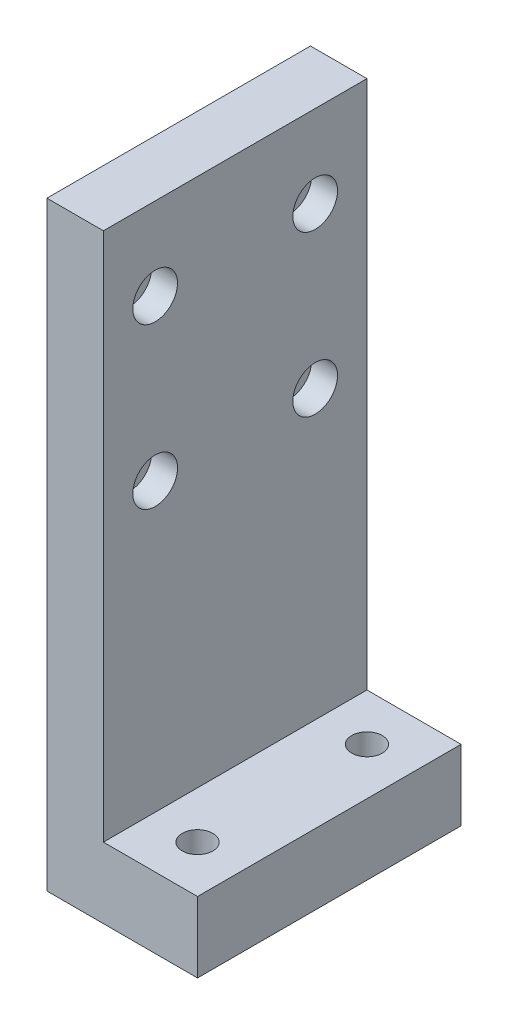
ISO-10303-21;
HEADER;
FILE_DESCRIPTION(('STEP AP214'),'2;1');
FILE_NAME('part.step','',(''),(''),'','','');
FILE_SCHEMA(('AUTOMOTIVE_DESIGN { 1 0 10303 214 1 1 1 1 }'));
ENDSEC;
DATA;
#1=APPLICATION_CONTEXT('core data for automotive mechanical design processes');
#2=APPLICATION_PROTOCOL_DEFINITION('international standard','automotive_design',2000,#1);
#3=PRODUCT_CONTEXT('',#1,'mechanical');
#4=PRODUCT('Part','Part','',(#3));
#5=PRODUCT_RELATED_PRODUCT_CATEGORY('part','',(#4));
#6=PRODUCT_DEFINITION_FORMATION('','',#4);
#7=PRODUCT_DEFINITION_CONTEXT('part definition',#1,'design');
#8=PRODUCT_DEFINITION('design','',#6,#7);
#9=PRODUCT_DEFINITION_SHAPE('','',#8);
#10=(LENGTH_UNIT() NAMED_UNIT(*) SI_UNIT(.MILLI.,.METRE.));
#11=(NAMED_UNIT(*) PLANE_ANGLE_UNIT() SI_UNIT($,.RADIAN.));
#12=(NAMED_UNIT(*) SI_UNIT($,.STERADIAN.) SOLID_ANGLE_UNIT());
#13=UNCERTAINTY_MEASURE_WITH_UNIT(LENGTH_MEASURE(1.E-05),#10,'distance_accuracy_value','');
#14=(GEOMETRIC_REPRESENTATION_CONTEXT(3) GLOBAL_UNCERTAINTY_ASSIGNED_CONTEXT((#13)) GLOBAL_UNIT_ASSIGNED_CONTEXT((#10,
#11,#12)) REPRESENTATION_CONTEXT('',''));
#15=CARTESIAN_POINT('',(0.,0.,0.));
#16=DIRECTION('',(0.,0.,1.));
#17=DIRECTION('',(1.,0.,0.));
#18=AXIS2_PLACEMENT_3D('',#15,#16,#17);
#19=CARTESIAN_POINT('',(-44.,75.9999999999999,45.));
#20=DIRECTION('',(1.,0.,0.));
#21=DIRECTION('',(0.,0.,-1.));
#22=AXIS2_PLACEMENT_3D('',#19,#20,#21);
#23=CYLINDRICAL_SURFACE('',#22,2.75);
#24=CARTESIAN_POINT('',(0.,75.9999999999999,45.));
#25=DIRECTION('',(1.,0.,0.));
#26=DIRECTION('',(0.,0.,-1.));
#27=AXIS2_PLACEMENT_3D('',#24,#25,#26);
#28=CIRCLE('',#27,2.75);
#29=CARTESIAN_POINT('',(0.,75.9999999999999,42.25));
#30=VERTEX_POINT('',#29);
#31=EDGE_CURVE('E144',#30,#30,#28,.T.);
#32=ORIENTED_EDGE('',*,*,#31,.F.);
#33=EDGE_LOOP('',(#32));
#34=FACE_BOUND('',#33,.T.);
#35=CARTESIAN_POINT('',(6.5,75.9999999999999,45.));
#36=DIRECTION('',(1.,0.,0.));
#37=DIRECTION('',(0.,0.,-1.));
#38=AXIS2_PLACEMENT_3D('',#35,#36,#37);
#39=CIRCLE('',#38,2.75);
#40=CARTESIAN_POINT('',(6.5,75.9999999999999,42.25));
#41=VERTEX_POINT('',#40);
#42=EDGE_CURVE('E161',#41,#41,#39,.F.);
#43=ORIENTED_EDGE('',*,*,#42,.F.);
#44=EDGE_LOOP('',(#43));
#45=FACE_BOUND('',#44,.T.);
#46=ADVANCED_FACE('F32',(#34,#45),#23,.F.);
#47=CARTESIAN_POINT('',(-44.,76.,11.));
#48=DIRECTION('',(1.,0.,0.));
#49=DIRECTION('',(0.,0.,-1.));
#50=AXIS2_PLACEMENT_3D('',#47,#48,#49);
#51=CYLINDRICAL_SURFACE('',#50,2.75);
#52=CARTESIAN_POINT('',(0.,76.,11.));
#53=DIRECTION('',(1.,0.,0.));
#54=DIRECTION('',(0.,0.,-1.));
#55=AXIS2_PLACEMENT_3D('',#52,#53,#54);
#56=CIRCLE('',#55,2.75);
#57=CARTESIAN_POINT('',(0.,76.,8.25));
#58=VERTEX_POINT('',#57);
#59=EDGE_CURVE('E141',#58,#58,#56,.T.);
#60=ORIENTED_EDGE('',*,*,#59,.F.);
#61=EDGE_LOOP('',(#60));
#62=FACE_BOUND('',#61,.T.);
#63=CARTESIAN_POINT('',(6.5,76.,11.));
#64=DIRECTION('',(1.,0.,0.));
#65=DIRECTION('',(0.,0.,-1.));
#66=AXIS2_PLACEMENT_3D('',#63,#64,#65);
#67=CIRCLE('',#66,2.75);
#68=CARTESIAN_POINT('',(6.5,76.,8.25));
#69=VERTEX_POINT('',#68);
#70=EDGE_CURVE('E156',#69,#69,#67,.F.);
#71=ORIENTED_EDGE('',*,*,#70,.F.);
#72=EDGE_LOOP('',(#71));
#73=FACE_BOUND('',#72,.T.);
#74=ADVANCED_FACE('F219',(#62,#73),#51,.F.);
#75=CARTESIAN_POINT('',(-44.,110.,11.));
#76=DIRECTION('',(1.,0.,0.));
#77=DIRECTION('',(0.,0.,-1.));
#78=AXIS2_PLACEMENT_3D('',#75,#76,#77);
#79=CYLINDRICAL_SURFACE('',#78,2.75);
#80=CARTESIAN_POINT('',(0.,110.,11.));
#81=DIRECTION('',(1.,0.,0.));
#82=DIRECTION('',(0.,0.,-1.));
#83=AXIS2_PLACEMENT_3D('',#80,#81,#82);
#84=CIRCLE('',#83,2.75);
#85=CARTESIAN_POINT('',(0.,110.,8.25));
#86=VERTEX_POINT('',#85);
#87=EDGE_CURVE('E138',#86,#86,#84,.T.);
#88=ORIENTED_EDGE('',*,*,#87,.F.);
#89=EDGE_LOOP('',(#88));
#90=FACE_BOUND('',#89,.T.);
#91=CARTESIAN_POINT('',(6.5,110.,11.));
#92=DIRECTION('',(1.,0.,0.));
#93=DIRECTION('',(0.,0.,-1.));
#94=AXIS2_PLACEMENT_3D('',#91,#92,#93);
#95=CIRCLE('',#94,2.75);
#96=CARTESIAN_POINT('',(6.5,110.,8.25));
#97=VERTEX_POINT('',#96);
#98=EDGE_CURVE('E151',#97,#97,#95,.F.);
#99=ORIENTED_EDGE('',*,*,#98,.F.);
#100=EDGE_LOOP('',(#99));
#101=FACE_BOUND('',#100,.T.);
#102=ADVANCED_FACE('F225',(#90,#101),#79,.F.);
#103=CARTESIAN_POINT('',(-44.,110.,45.));
#104=DIRECTION('',(1.,0.,0.));
#105=DIRECTION('',(0.,0.,-1.));
#106=AXIS2_PLACEMENT_3D('',#103,#104,#105);
#107=CYLINDRICAL_SURFACE('',#106,2.75);
#108=CARTESIAN_POINT('',(0.,110.,45.));
#109=DIRECTION('',(1.,0.,0.));
#110=DIRECTION('',(0.,0.,-1.));
#111=AXIS2_PLACEMENT_3D('',#108,#109,#110);
#112=CIRCLE('',#111,2.75);
#113=CARTESIAN_POINT('',(0.,110.,42.25));
#114=VERTEX_POINT('',#113);
#115=EDGE_CURVE('E123',#114,#114,#112,.T.);
#116=ORIENTED_EDGE('',*,*,#115,.F.);
#117=EDGE_LOOP('',(#116));
#118=FACE_BOUND('',#117,.T.);
#119=CARTESIAN_POINT('',(6.5,110.,45.));
#120=DIRECTION('',(1.,0.,0.));
#121=DIRECTION('',(0.,0.,-1.));
#122=AXIS2_PLACEMENT_3D('',#119,#120,#121);
#123=CIRCLE('',#122,2.75);
#124=CARTESIAN_POINT('',(6.5,110.,42.25));
#125=VERTEX_POINT('',#124);
#126=EDGE_CURVE('E147',#125,#125,#123,.F.);
#127=ORIENTED_EDGE('',*,*,#126,.F.);
#128=EDGE_LOOP('',(#127));
#129=FACE_BOUND('',#128,.T.);
#130=ADVANCED_FACE('F236',(#118,#129),#107,.F.);
#131=CARTESIAN_POINT('',(0.,0.,56.));
#132=DIRECTION('',(0.,1.,0.));
#133=DIRECTION('',(0.,0.,1.));
#134=AXIS2_PLACEMENT_3D('',#131,#132,#133);
#135=PLANE('',#134);
#136=CARTESIAN_POINT('',(22.,0.,46.));
#137=DIRECTION('',(0.,1.,0.));
#138=DIRECTION('',(0.,0.,1.));
#139=AXIS2_PLACEMENT_3D('',#136,#137,#138);
#140=CIRCLE('',#139,3.25);
#141=CARTESIAN_POINT('',(22.,0.,49.25));
#142=VERTEX_POINT('',#141);
#143=EDGE_CURVE('E178',#142,#142,#140,.T.);
#144=ORIENTED_EDGE('',*,*,#143,.T.);
#145=EDGE_LOOP('',(#144));
#146=FACE_BOUND('',#145,.T.);
#147=CARTESIAN_POINT('',(22.,0.,10.));
#148=DIRECTION('',(0.,1.,0.));
#149=DIRECTION('',(0.,0.,1.));
#150=AXIS2_PLACEMENT_3D('',#147,#148,#149);
#151=CIRCLE('',#150,3.25);
#152=CARTESIAN_POINT('',(22.,0.,13.25));
#153=VERTEX_POINT('',#152);
#154=EDGE_CURVE('E168',#153,#153,#151,.T.);
#155=ORIENTED_EDGE('',*,*,#154,.T.);
#156=EDGE_LOOP('',(#155));
#157=FACE_BOUND('',#156,.T.);
#158=DIRECTION('',(1.,0.,0.));
#159=VECTOR('',#158,1.);
#160=CARTESIAN_POINT('',(0.,0.,0.));
#161=LINE('',#160,#159);
#162=CARTESIAN_POINT('',(0.,0.,0.));
#163=VERTEX_POINT('',#162);
#164=CARTESIAN_POINT('',(32.,0.,0.));
#165=VERTEX_POINT('',#164);
#166=EDGE_CURVE('E119',#163,#165,#161,.T.);
#167=ORIENTED_EDGE('',*,*,#166,.T.);
#168=DIRECTION('',(0.,0.,-1.));
#169=VECTOR('',#168,1.);
#170=CARTESIAN_POINT('',(32.,0.,56.));
#171=LINE('',#170,#169);
#172=CARTESIAN_POINT('',(32.,0.,56.));
#173=VERTEX_POINT('',#172);
#174=EDGE_CURVE('E11',#173,#165,#171,.T.);
#175=ORIENTED_EDGE('',*,*,#174,.F.);
#176=DIRECTION('',(1.,0.,0.));
#177=VECTOR('',#176,1.);
#178=CARTESIAN_POINT('',(0.,0.,56.));
#179=LINE('',#178,#177);
#180=CARTESIAN_POINT('',(0.,0.,56.));
#181=VERTEX_POINT('',#180);
#182=EDGE_CURVE('E130',#181,#173,#179,.T.);
#183=ORIENTED_EDGE('',*,*,#182,.F.);
#184=DIRECTION('',(0.,0.,-1.));
#185=VECTOR('',#184,1.);
#186=CARTESIAN_POINT('',(0.,0.,56.));
#187=LINE('',#186,#185);
#188=EDGE_CURVE('E115',#181,#163,#187,.T.);
#189=ORIENTED_EDGE('',*,*,#188,.T.);
#190=EDGE_LOOP('',(#167,#175,#183,#189));
#191=FACE_BOUND('',#190,.T.);
#192=ADVANCED_FACE('F34',(#146,#157,#191),#135,.F.);
#193=CARTESIAN_POINT('',(32.,0.,56.));
#194=DIRECTION('',(-1.,0.,0.));
#195=DIRECTION('',(0.,0.,1.));
#196=AXIS2_PLACEMENT_3D('',#193,#194,#195);
#197=PLANE('',#196);
#198=DIRECTION('',(0.,1.,0.));
#199=VECTOR('',#198,1.);
#200=CARTESIAN_POINT('',(32.,0.,0.));
#201=LINE('',#200,#199);
#202=CARTESIAN_POINT('',(32.,15.,0.));
#203=VERTEX_POINT('',#202);
#204=EDGE_CURVE('E122',#165,#203,#201,.T.);
#205=ORIENTED_EDGE('',*,*,#204,.T.);
#206=DIRECTION('',(0.,0.,-1.));
#207=VECTOR('',#206,1.);
#208=CARTESIAN_POINT('',(32.,15.,56.));
#209=LINE('',#208,#207);
#210=CARTESIAN_POINT('',(32.,15.,56.));
#211=VERTEX_POINT('',#210);
#212=EDGE_CURVE('E42',#211,#203,#209,.T.);
#213=ORIENTED_EDGE('',*,*,#212,.F.);
#214=DIRECTION('',(0.,1.,0.));
#215=VECTOR('',#214,1.);
#216=CARTESIAN_POINT('',(32.,0.,56.));
#217=LINE('',#216,#215);
#218=EDGE_CURVE('E88',#173,#211,#217,.T.);
#219=ORIENTED_EDGE('',*,*,#218,.F.);
#220=ORIENTED_EDGE('',*,*,#174,.T.);
#221=EDGE_LOOP('',(#205,#213,#219,#220));
#222=FACE_BOUND('',#221,.T.);
#223=ADVANCED_FACE('F198',(#222),#197,.F.);
#224=CARTESIAN_POINT('',(12.,15.,56.));
#225=DIRECTION('',(0.,-1.,0.));
#226=DIRECTION('',(0.,0.,-1.));
#227=AXIS2_PLACEMENT_3D('',#224,#225,#226);
#228=PLANE('',#227);
#229=CARTESIAN_POINT('',(22.,15.,46.));
#230=DIRECTION('',(0.,-1.,0.));
#231=DIRECTION('',(0.,0.,-1.));
#232=AXIS2_PLACEMENT_3D('',#229,#230,#231);
#233=CIRCLE('',#232,3.25);
#234=CARTESIAN_POINT('',(22.,15.,42.75));
#235=VERTEX_POINT('',#234);
#236=EDGE_CURVE('E36',#235,#235,#233,.T.);
#237=ORIENTED_EDGE('',*,*,#236,.T.);
#238=EDGE_LOOP('',(#237));
#239=FACE_BOUND('',#238,.T.);
#240=CARTESIAN_POINT('',(22.,15.,10.));
#241=DIRECTION('',(0.,-1.,0.));
#242=DIRECTION('',(0.,0.,-1.));
#243=AXIS2_PLACEMENT_3D('',#240,#241,#242);
#244=CIRCLE('',#243,3.25);
#245=CARTESIAN_POINT('',(22.,15.,6.75));
#246=VERTEX_POINT('',#245);
#247=EDGE_CURVE('E165',#246,#246,#244,.T.);
#248=ORIENTED_EDGE('',*,*,#247,.T.);
#249=EDGE_LOOP('',(#248));
#250=FACE_BOUND('',#249,.T.);
#251=DIRECTION('',(-1.,0.,0.));
#252=VECTOR('',#251,1.);
#253=CARTESIAN_POINT('',(12.,15.,0.));
#254=LINE('',#253,#252);
#255=CARTESIAN_POINT('',(12.,15.,0.));
#256=VERTEX_POINT('',#255);
#257=EDGE_CURVE('E125',#203,#256,#254,.T.);
#258=ORIENTED_EDGE('',*,*,#257,.T.);
#259=DIRECTION('',(0.,0.,-1.));
#260=VECTOR('',#259,1.);
#261=CARTESIAN_POINT('',(12.,15.,56.));
#262=LINE('',#261,#260);
#263=CARTESIAN_POINT('',(12.,15.,56.));
#264=VERTEX_POINT('',#263);
#265=EDGE_CURVE('E110',#264,#256,#262,.T.);
#266=ORIENTED_EDGE('',*,*,#265,.F.);
#267=DIRECTION('',(-1.,0.,0.));
#268=VECTOR('',#267,1.);
#269=CARTESIAN_POINT('',(12.,15.,56.));
#270=LINE('',#269,#268);
#271=EDGE_CURVE('E101',#211,#264,#270,.T.);
#272=ORIENTED_EDGE('',*,*,#271,.F.);
#273=ORIENTED_EDGE('',*,*,#212,.T.);
#274=EDGE_LOOP('',(#258,#266,#272,#273));
#275=FACE_BOUND('',#274,.T.);
#276=ADVANCED_FACE('F201',(#239,#250,#275),#228,.F.);
#277=CARTESIAN_POINT('',(12.,15.,56.));
#278=DIRECTION('',(-1.,0.,0.));
#279=DIRECTION('',(0.,0.,1.));
#280=AXIS2_PLACEMENT_3D('',#277,#278,#279);
#281=PLANE('',#280);
#282=CARTESIAN_POINT('',(12.,75.9999999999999,45.));
#283=DIRECTION('',(1.,0.,0.));
#284=DIRECTION('',(0.,0.,-1.));
#285=AXIS2_PLACEMENT_3D('',#282,#283,#284);
#286=CIRCLE('',#285,4.75);
#287=CARTESIAN_POINT('',(12.,75.9999999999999,40.25));
#288=VERTEX_POINT('',#287);
#289=EDGE_CURVE('E167',#288,#288,#286,.T.);
#290=ORIENTED_EDGE('',*,*,#289,.F.);
#291=EDGE_LOOP('',(#290));
#292=FACE_BOUND('',#291,.T.);
#293=CARTESIAN_POINT('',(12.,76.,11.));
#294=DIRECTION('',(1.,0.,0.));
#295=DIRECTION('',(0.,0.,-1.));
#296=AXIS2_PLACEMENT_3D('',#293,#294,#295);
#297=CIRCLE('',#296,4.75);
#298=CARTESIAN_POINT('',(12.,76.,6.25));
#299=VERTEX_POINT('',#298);
#300=EDGE_CURVE('E163',#299,#299,#297,.T.);
#301=ORIENTED_EDGE('',*,*,#300,.F.);
#302=EDGE_LOOP('',(#301));
#303=FACE_BOUND('',#302,.T.);
#304=CARTESIAN_POINT('',(12.,110.,11.));
#305=DIRECTION('',(1.,0.,0.));
#306=DIRECTION('',(0.,0.,-1.));
#307=AXIS2_PLACEMENT_3D('',#304,#305,#306);
#308=CIRCLE('',#307,4.75);
#309=CARTESIAN_POINT('',(12.,110.,6.25));
#310=VERTEX_POINT('',#309);
#311=EDGE_CURVE('E159',#310,#310,#308,.T.);
#312=ORIENTED_EDGE('',*,*,#311,.F.);
#313=EDGE_LOOP('',(#312));
#314=FACE_BOUND('',#313,.T.);
#315=CARTESIAN_POINT('',(12.,110.,45.));
#316=DIRECTION('',(1.,0.,0.));
#317=DIRECTION('',(0.,0.,-1.));
#318=AXIS2_PLACEMENT_3D('',#315,#316,#317);
#319=CIRCLE('',#318,4.75);
#320=CARTESIAN_POINT('',(12.,110.,40.25));
#321=VERTEX_POINT('',#320);
#322=EDGE_CURVE('E154',#321,#321,#319,.T.);
#323=ORIENTED_EDGE('',*,*,#322,.F.);
#324=EDGE_LOOP('',(#323));
#325=FACE_BOUND('',#324,.T.);
#326=DIRECTION('',(0.,1.,0.));
#327=VECTOR('',#326,1.);
#328=CARTESIAN_POINT('',(12.,15.,0.));
#329=LINE('',#328,#327);
#330=CARTESIAN_POINT('',(12.,127.5,0.));
#331=VERTEX_POINT('',#330);
#332=EDGE_CURVE('E109',#256,#331,#329,.T.);
#333=ORIENTED_EDGE('',*,*,#332,.T.);
#334=DIRECTION('',(0.,0.,-1.));
#335=VECTOR('',#334,1.);
#336=CARTESIAN_POINT('',(12.,127.5,56.));
#337=LINE('',#336,#335);
#338=CARTESIAN_POINT('',(12.,127.5,56.));
#339=VERTEX_POINT('',#338);
#340=EDGE_CURVE('E106',#339,#331,#337,.T.);
#341=ORIENTED_EDGE('',*,*,#340,.F.);
#342=DIRECTION('',(0.,1.,0.));
#343=VECTOR('',#342,1.);
#344=CARTESIAN_POINT('',(12.,15.,56.));
#345=LINE('',#344,#343);
#346=EDGE_CURVE('E95',#264,#339,#345,.T.);
#347=ORIENTED_EDGE('',*,*,#346,.F.);
#348=ORIENTED_EDGE('',*,*,#265,.T.);
#349=EDGE_LOOP('',(#333,#341,#347,#348));
#350=FACE_BOUND('',#349,.T.);
#351=ADVANCED_FACE('F107',(#292,#303,#314,#325,#350),#281,.F.);
#352=CARTESIAN_POINT('',(0.,127.5,56.));
#353=DIRECTION('',(0.,-1.,0.));
#354=DIRECTION('',(0.,0.,-1.));
#355=AXIS2_PLACEMENT_3D('',#352,#353,#354);
#356=PLANE('',#355);
#357=DIRECTION('',(-1.,0.,0.));
#358=VECTOR('',#357,1.);
#359=CARTESIAN_POINT('',(0.,127.5,0.));
#360=LINE('',#359,#358);
#361=CARTESIAN_POINT('',(0.,127.5,0.));
#362=VERTEX_POINT('',#361);
#363=EDGE_CURVE('E74',#331,#362,#360,.T.);
#364=ORIENTED_EDGE('',*,*,#363,.T.);
#365=DIRECTION('',(0.,0.,-1.));
#366=VECTOR('',#365,1.);
#367=CARTESIAN_POINT('',(0.,127.5,56.));
#368=LINE('',#367,#366);
#369=CARTESIAN_POINT('',(0.,127.5,56.));
#370=VERTEX_POINT('',#369);
#371=EDGE_CURVE('E111',#370,#362,#368,.T.);
#372=ORIENTED_EDGE('',*,*,#371,.F.);
#373=DIRECTION('',(-1.,0.,0.));
#374=VECTOR('',#373,1.);
#375=CARTESIAN_POINT('',(0.,127.5,56.));
#376=LINE('',#375,#374);
#377=EDGE_CURVE('E99',#339,#370,#376,.T.);
#378=ORIENTED_EDGE('',*,*,#377,.F.);
#379=ORIENTED_EDGE('',*,*,#340,.T.);
#380=EDGE_LOOP('',(#364,#372,#378,#379));
#381=FACE_BOUND('',#380,.T.);
#382=ADVANCED_FACE('F113',(#381),#356,.F.);
#383=CARTESIAN_POINT('',(0.,0.,56.));
#384=DIRECTION('',(1.,0.,0.));
#385=DIRECTION('',(0.,0.,-1.));
#386=AXIS2_PLACEMENT_3D('',#383,#384,#385);
#387=PLANE('',#386);
#388=ORIENTED_EDGE('',*,*,#31,.T.);
#389=EDGE_LOOP('',(#388));
#390=FACE_BOUND('',#389,.T.);
#391=ORIENTED_EDGE('',*,*,#59,.T.);
#392=EDGE_LOOP('',(#391));
#393=FACE_BOUND('',#392,.T.);
#394=ORIENTED_EDGE('',*,*,#87,.T.);
#395=EDGE_LOOP('',(#394));
#396=FACE_BOUND('',#395,.T.);
#397=ORIENTED_EDGE('',*,*,#115,.T.);
#398=EDGE_LOOP('',(#397));
#399=FACE_BOUND('',#398,.T.);
#400=DIRECTION('',(0.,-1.,0.));
#401=VECTOR('',#400,1.);
#402=CARTESIAN_POINT('',(0.,0.,0.));
#403=LINE('',#402,#401);
#404=EDGE_CURVE('E80',#362,#163,#403,.T.);
#405=ORIENTED_EDGE('',*,*,#404,.T.);
#406=ORIENTED_EDGE('',*,*,#188,.F.);
#407=DIRECTION('',(0.,-1.,0.));
#408=VECTOR('',#407,1.);
#409=CARTESIAN_POINT('',(0.,0.,56.));
#410=LINE('',#409,#408);
#411=EDGE_CURVE('E51',#370,#181,#410,.T.);
#412=ORIENTED_EDGE('',*,*,#411,.F.);
#413=ORIENTED_EDGE('',*,*,#371,.T.);
#414=EDGE_LOOP('',(#405,#406,#412,#413));
#415=FACE_BOUND('',#414,.T.);
#416=ADVANCED_FACE('F206',(#390,#393,#396,#399,#415),#387,.F.);
#417=CARTESIAN_POINT('',(32.,0.,56.));
#418=DIRECTION('',(0.,0.,1.));
#419=DIRECTION('',(1.,0.,0.));
#420=AXIS2_PLACEMENT_3D('',#417,#418,#419);
#421=PLANE('',#420);
#422=ORIENTED_EDGE('',*,*,#182,.T.);
#423=ORIENTED_EDGE('',*,*,#218,.T.);
#424=ORIENTED_EDGE('',*,*,#271,.T.);
#425=ORIENTED_EDGE('',*,*,#346,.T.);
#426=ORIENTED_EDGE('',*,*,#377,.T.);
#427=ORIENTED_EDGE('',*,*,#411,.T.);
#428=EDGE_LOOP('',(#422,#423,#424,#425,#426,#427));
#429=FACE_BOUND('',#428,.T.);
#430=ADVANCED_FACE('F97',(#429),#421,.T.);
#431=CARTESIAN_POINT('',(32.,0.,0.));
#432=DIRECTION('',(0.,0.,1.));
#433=DIRECTION('',(1.,0.,0.));
#434=AXIS2_PLACEMENT_3D('',#431,#432,#433);
#435=PLANE('',#434);
#436=ORIENTED_EDGE('',*,*,#166,.F.);
#437=ORIENTED_EDGE('',*,*,#404,.F.);
#438=ORIENTED_EDGE('',*,*,#363,.F.);
#439=ORIENTED_EDGE('',*,*,#332,.F.);
#440=ORIENTED_EDGE('',*,*,#257,.F.);
#441=ORIENTED_EDGE('',*,*,#204,.F.);
#442=EDGE_LOOP('',(#436,#437,#438,#439,#440,#441));
#443=FACE_BOUND('',#442,.T.);
#444=ADVANCED_FACE('F204',(#443),#435,.F.);
#445=CARTESIAN_POINT('',(6.5,110.,45.));
#446=DIRECTION('',(1.,0.,0.));
#447=DIRECTION('',(0.,0.,-1.));
#448=AXIS2_PLACEMENT_3D('',#445,#446,#447);
#449=PLANE('',#448);
#450=CARTESIAN_POINT('',(6.5,110.,45.));
#451=DIRECTION('',(1.,0.,0.));
#452=DIRECTION('',(0.,0.,-1.));
#453=AXIS2_PLACEMENT_3D('',#450,#451,#452);
#454=CIRCLE('',#453,4.75);
#455=CARTESIAN_POINT('',(6.5,110.,40.25));
#456=VERTEX_POINT('',#455);
#457=EDGE_CURVE('E150',#456,#456,#454,.T.);
#458=ORIENTED_EDGE('',*,*,#457,.T.);
#459=EDGE_LOOP('',(#458));
#460=FACE_BOUND('',#459,.T.);
#461=ORIENTED_EDGE('',*,*,#126,.T.);
#462=EDGE_LOOP('',(#461));
#463=FACE_BOUND('',#462,.T.);
#464=ADVANCED_FACE('F241',(#460,#463),#449,.T.);
#465=CARTESIAN_POINT('',(6.5,110.,45.));
#466=DIRECTION('',(1.,0.,0.));
#467=DIRECTION('',(0.,0.,-1.));
#468=AXIS2_PLACEMENT_3D('',#465,#466,#467);
#469=CYLINDRICAL_SURFACE('',#468,4.75);
#470=ORIENTED_EDGE('',*,*,#457,.F.);
#471=EDGE_LOOP('',(#470));
#472=FACE_BOUND('',#471,.T.);
#473=ORIENTED_EDGE('',*,*,#322,.T.);
#474=EDGE_LOOP('',(#473));
#475=FACE_BOUND('',#474,.T.);
#476=ADVANCED_FACE('F231',(#472,#475),#469,.F.);
#477=CARTESIAN_POINT('',(6.5,110.,11.));
#478=DIRECTION('',(1.,0.,0.));
#479=DIRECTION('',(0.,0.,-1.));
#480=AXIS2_PLACEMENT_3D('',#477,#478,#479);
#481=PLANE('',#480);
#482=CARTESIAN_POINT('',(6.5,110.,11.));
#483=DIRECTION('',(1.,0.,0.));
#484=DIRECTION('',(0.,0.,-1.));
#485=AXIS2_PLACEMENT_3D('',#482,#483,#484);
#486=CIRCLE('',#485,4.75);
#487=CARTESIAN_POINT('',(6.5,110.,6.25));
#488=VERTEX_POINT('',#487);
#489=EDGE_CURVE('E155',#488,#488,#486,.T.);
#490=ORIENTED_EDGE('',*,*,#489,.T.);
#491=EDGE_LOOP('',(#490));
#492=FACE_BOUND('',#491,.T.);
#493=ORIENTED_EDGE('',*,*,#98,.T.);
#494=EDGE_LOOP('',(#493));
#495=FACE_BOUND('',#494,.T.);
#496=ADVANCED_FACE('F249',(#492,#495),#481,.T.);
#497=CARTESIAN_POINT('',(6.5,110.,11.));
#498=DIRECTION('',(1.,0.,0.));
#499=DIRECTION('',(0.,0.,-1.));
#500=AXIS2_PLACEMENT_3D('',#497,#498,#499);
#501=CYLINDRICAL_SURFACE('',#500,4.75);
#502=ORIENTED_EDGE('',*,*,#489,.F.);
#503=EDGE_LOOP('',(#502));
#504=FACE_BOUND('',#503,.T.);
#505=ORIENTED_EDGE('',*,*,#311,.T.);
#506=EDGE_LOOP('',(#505));
#507=FACE_BOUND('',#506,.T.);
#508=ADVANCED_FACE('F253',(#504,#507),#501,.F.);
#509=CARTESIAN_POINT('',(6.5,76.,11.));
#510=DIRECTION('',(1.,0.,0.));
#511=DIRECTION('',(0.,0.,-1.));
#512=AXIS2_PLACEMENT_3D('',#509,#510,#511);
#513=PLANE('',#512);
#514=CARTESIAN_POINT('',(6.5,76.,11.));
#515=DIRECTION('',(1.,0.,0.));
#516=DIRECTION('',(0.,0.,-1.));
#517=AXIS2_PLACEMENT_3D('',#514,#515,#516);
#518=CIRCLE('',#517,4.75);
#519=CARTESIAN_POINT('',(6.5,76.,6.25));
#520=VERTEX_POINT('',#519);
#521=EDGE_CURVE('E160',#520,#520,#518,.T.);
#522=ORIENTED_EDGE('',*,*,#521,.T.);
#523=EDGE_LOOP('',(#522));
#524=FACE_BOUND('',#523,.T.);
#525=ORIENTED_EDGE('',*,*,#70,.T.);
#526=EDGE_LOOP('',(#525));
#527=FACE_BOUND('',#526,.T.);
#528=ADVANCED_FACE('F256',(#524,#527),#513,.T.);
#529=CARTESIAN_POINT('',(6.5,76.,11.));
#530=DIRECTION('',(1.,0.,0.));
#531=DIRECTION('',(0.,0.,-1.));
#532=AXIS2_PLACEMENT_3D('',#529,#530,#531);
#533=CYLINDRICAL_SURFACE('',#532,4.75);
#534=ORIENTED_EDGE('',*,*,#521,.F.);
#535=EDGE_LOOP('',(#534));
#536=FACE_BOUND('',#535,.T.);
#537=ORIENTED_EDGE('',*,*,#300,.T.);
#538=EDGE_LOOP('',(#537));
#539=FACE_BOUND('',#538,.T.);
#540=ADVANCED_FACE('F261',(#536,#539),#533,.F.);
#541=CARTESIAN_POINT('',(6.5,75.9999999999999,45.));
#542=DIRECTION('',(1.,0.,0.));
#543=DIRECTION('',(0.,0.,-1.));
#544=AXIS2_PLACEMENT_3D('',#541,#542,#543);
#545=PLANE('',#544);
#546=CARTESIAN_POINT('',(6.5,75.9999999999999,45.));
#547=DIRECTION('',(1.,0.,0.));
#548=DIRECTION('',(0.,0.,-1.));
#549=AXIS2_PLACEMENT_3D('',#546,#547,#548);
#550=CIRCLE('',#549,4.75);
#551=CARTESIAN_POINT('',(6.5,75.9999999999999,40.25));
#552=VERTEX_POINT('',#551);
#553=EDGE_CURVE('E164',#552,#552,#550,.T.);
#554=ORIENTED_EDGE('',*,*,#553,.T.);
#555=EDGE_LOOP('',(#554));
#556=FACE_BOUND('',#555,.T.);
#557=ORIENTED_EDGE('',*,*,#42,.T.);
#558=EDGE_LOOP('',(#557));
#559=FACE_BOUND('',#558,.T.);
#560=ADVANCED_FACE('F264',(#556,#559),#545,.T.);
#561=CARTESIAN_POINT('',(6.5,75.9999999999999,45.));
#562=DIRECTION('',(1.,0.,0.));
#563=DIRECTION('',(0.,0.,-1.));
#564=AXIS2_PLACEMENT_3D('',#561,#562,#563);
#565=CYLINDRICAL_SURFACE('',#564,4.75);
#566=ORIENTED_EDGE('',*,*,#553,.F.);
#567=EDGE_LOOP('',(#566));
#568=FACE_BOUND('',#567,.T.);
#569=ORIENTED_EDGE('',*,*,#289,.T.);
#570=EDGE_LOOP('',(#569));
#571=FACE_BOUND('',#570,.T.);
#572=ADVANCED_FACE('F269',(#568,#571),#565,.F.);
#573=CARTESIAN_POINT('',(22.,0.,10.));
#574=DIRECTION('',(0.,1.,0.));
#575=DIRECTION('',(0.,0.,1.));
#576=AXIS2_PLACEMENT_3D('',#573,#574,#575);
#577=CYLINDRICAL_SURFACE('',#576,3.25);
#578=ORIENTED_EDGE('',*,*,#154,.F.);
#579=EDGE_LOOP('',(#578));
#580=FACE_BOUND('',#579,.T.);
#581=ORIENTED_EDGE('',*,*,#247,.F.);
#582=EDGE_LOOP('',(#581));
#583=FACE_BOUND('',#582,.T.);
#584=ADVANCED_FACE('F272',(#580,#583),#577,.F.);
#585=CARTESIAN_POINT('',(22.,0.,46.));
#586=DIRECTION('',(0.,1.,0.));
#587=DIRECTION('',(0.,0.,1.));
#588=AXIS2_PLACEMENT_3D('',#585,#586,#587);
#589=CYLINDRICAL_SURFACE('',#588,3.25);
#590=ORIENTED_EDGE('',*,*,#143,.F.);
#591=EDGE_LOOP('',(#590));
#592=FACE_BOUND('',#591,.T.);
#593=ORIENTED_EDGE('',*,*,#236,.F.);
#594=EDGE_LOOP('',(#593));
#595=FACE_BOUND('',#594,.T.);
#596=ADVANCED_FACE('F279',(#592,#595),#589,.F.);
#597=CLOSED_SHELL('',(#46,#74,#102,#130,#192,#223,#276,#351,#382,#416,#430,#444,#464,#476,#496,
#508,#528,#540,#560,#572,#584,#596));
#598=MANIFOLD_SOLID_BREP('B2',#597);
#599=ADVANCED_BREP_SHAPE_REPRESENTATION('',(#18,#598),#14);
#600=SHAPE_DEFINITION_REPRESENTATION(#9,#599);
ENDSEC;
END-ISO-10303-21;
